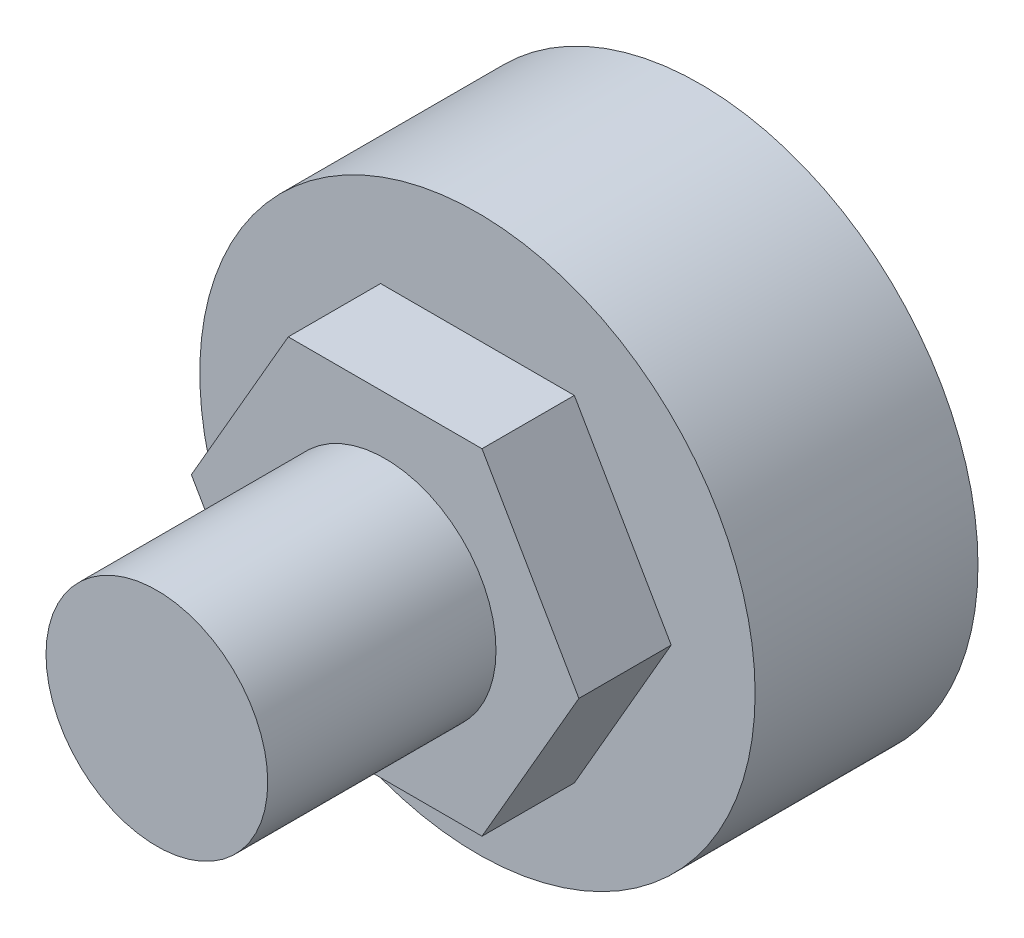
ISO-10303-21;
HEADER;
FILE_DESCRIPTION(('STEP AP214'),'2;1');
FILE_NAME('part.step','',(''),(''),'','','');
FILE_SCHEMA(('AUTOMOTIVE_DESIGN { 1 0 10303 214 1 1 1 1 }'));
ENDSEC;
DATA;
#1=APPLICATION_CONTEXT('core data for automotive mechanical design processes');
#2=APPLICATION_PROTOCOL_DEFINITION('international standard','automotive_design',2000,#1);
#3=PRODUCT_CONTEXT('',#1,'mechanical');
#4=PRODUCT('Part','Part','',(#3));
#5=PRODUCT_RELATED_PRODUCT_CATEGORY('part','',(#4));
#6=PRODUCT_DEFINITION_FORMATION('','',#4);
#7=PRODUCT_DEFINITION_CONTEXT('part definition',#1,'design');
#8=PRODUCT_DEFINITION('design','',#6,#7);
#9=PRODUCT_DEFINITION_SHAPE('','',#8);
#10=(LENGTH_UNIT() NAMED_UNIT(*) SI_UNIT(.MILLI.,.METRE.));
#11=(NAMED_UNIT(*) PLANE_ANGLE_UNIT() SI_UNIT($,.RADIAN.));
#12=(NAMED_UNIT(*) SI_UNIT($,.STERADIAN.) SOLID_ANGLE_UNIT());
#13=UNCERTAINTY_MEASURE_WITH_UNIT(LENGTH_MEASURE(1.E-05),#10,'distance_accuracy_value','');
#14=(GEOMETRIC_REPRESENTATION_CONTEXT(3) GLOBAL_UNCERTAINTY_ASSIGNED_CONTEXT((#13)) GLOBAL_UNIT_ASSIGNED_CONTEXT((#10,
#11,#12)) REPRESENTATION_CONTEXT('',''));
#15=CARTESIAN_POINT('',(0.,0.,0.));
#16=DIRECTION('',(0.,0.,1.));
#17=DIRECTION('',(1.,0.,0.));
#18=AXIS2_PLACEMENT_3D('',#15,#16,#17);
#19=CARTESIAN_POINT('',(0.,0.,11.13));
#20=DIRECTION('',(0.,0.,1.));
#21=DIRECTION('',(1.,0.,0.));
#22=AXIS2_PLACEMENT_3D('',#19,#20,#21);
#23=PLANE('',#22);
#24=DIRECTION('',(-0.5,0.866025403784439,0.));
#25=VECTOR('',#24,1.);
#26=CARTESIAN_POINT('',(6.84160068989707,0.,11.13));
#27=LINE('',#26,#25);
#28=CARTESIAN_POINT('',(6.84160068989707,0.,11.13));
#29=VERTEX_POINT('',#28);
#30=CARTESIAN_POINT('',(3.42080034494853,5.925,11.13));
#31=VERTEX_POINT('',#30);
#32=EDGE_CURVE('E145',#29,#31,#27,.T.);
#33=ORIENTED_EDGE('',*,*,#32,.T.);
#34=DIRECTION('',(-1.,0.,0.));
#35=VECTOR('',#34,1.);
#36=CARTESIAN_POINT('',(3.42080034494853,5.925,11.13));
#37=LINE('',#36,#35);
#38=CARTESIAN_POINT('',(-3.42080034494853,5.925,11.13));
#39=VERTEX_POINT('',#38);
#40=EDGE_CURVE('E91',#31,#39,#37,.T.);
#41=ORIENTED_EDGE('',*,*,#40,.T.);
#42=DIRECTION('',(-0.5,-0.866025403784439,0.));
#43=VECTOR('',#42,1.);
#44=CARTESIAN_POINT('',(-3.42080034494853,5.925,11.13));
#45=LINE('',#44,#43);
#46=CARTESIAN_POINT('',(-6.84160068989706,0.,11.13));
#47=VERTEX_POINT('',#46);
#48=EDGE_CURVE('E107',#39,#47,#45,.T.);
#49=ORIENTED_EDGE('',*,*,#48,.T.);
#50=DIRECTION('',(0.5,-0.866025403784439,0.));
#51=VECTOR('',#50,1.);
#52=CARTESIAN_POINT('',(-6.84160068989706,0.,11.13));
#53=LINE('',#52,#51);
#54=CARTESIAN_POINT('',(-3.42080034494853,-5.925,11.13));
#55=VERTEX_POINT('',#54);
#56=EDGE_CURVE('E101',#47,#55,#53,.T.);
#57=ORIENTED_EDGE('',*,*,#56,.T.);
#58=DIRECTION('',(1.,0.,0.));
#59=VECTOR('',#58,1.);
#60=CARTESIAN_POINT('',(-3.42080034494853,-5.925,11.13));
#61=LINE('',#60,#59);
#62=CARTESIAN_POINT('',(3.42080034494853,-5.925,11.13));
#63=VERTEX_POINT('',#62);
#64=EDGE_CURVE('E105',#55,#63,#61,.T.);
#65=ORIENTED_EDGE('',*,*,#64,.T.);
#66=DIRECTION('',(0.5,0.866025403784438,0.));
#67=VECTOR('',#66,1.);
#68=CARTESIAN_POINT('',(3.42080034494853,-5.925,11.13));
#69=LINE('',#68,#67);
#70=EDGE_CURVE('E61',#63,#29,#69,.T.);
#71=ORIENTED_EDGE('',*,*,#70,.T.);
#72=EDGE_LOOP('',(#33,#41,#49,#57,#65,#71));
#73=FACE_BOUND('',#72,.T.);
#74=CARTESIAN_POINT('',(0.,0.,11.13));
#75=DIRECTION('',(0.,0.,1.));
#76=DIRECTION('',(1.,0.,0.));
#77=AXIS2_PLACEMENT_3D('',#74,#75,#76);
#78=CIRCLE('',#77,3.915);
#79=CARTESIAN_POINT('',(3.915,0.,11.13));
#80=VERTEX_POINT('',#79);
#81=EDGE_CURVE('E207',#80,#80,#78,.T.);
#82=ORIENTED_EDGE('',*,*,#81,.F.);
#83=EDGE_LOOP('',(#82));
#84=FACE_BOUND('',#83,.T.);
#85=ADVANCED_FACE('F37',(#73,#84),#23,.T.);
#86=CARTESIAN_POINT('',(0.,0.,7.87));
#87=DIRECTION('',(0.,0.,1.));
#88=DIRECTION('',(1.,0.,0.));
#89=AXIS2_PLACEMENT_3D('',#86,#87,#88);
#90=PLANE('',#89);
#91=CARTESIAN_POINT('',(0.,0.,7.87));
#92=DIRECTION('',(0.,0.,1.));
#93=DIRECTION('',(1.,0.,0.));
#94=AXIS2_PLACEMENT_3D('',#91,#92,#93);
#95=CIRCLE('',#94,9.805);
#96=CARTESIAN_POINT('',(9.805,0.,7.87));
#97=VERTEX_POINT('',#96);
#98=EDGE_CURVE('E11',#97,#97,#95,.T.);
#99=ORIENTED_EDGE('',*,*,#98,.T.);
#100=EDGE_LOOP('',(#99));
#101=FACE_BOUND('',#100,.T.);
#102=DIRECTION('',(-1.,0.,0.));
#103=VECTOR('',#102,1.);
#104=CARTESIAN_POINT('',(3.42080034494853,5.925,7.87));
#105=LINE('',#104,#103);
#106=CARTESIAN_POINT('',(3.42080034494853,5.925,7.87));
#107=VERTEX_POINT('',#106);
#108=CARTESIAN_POINT('',(-3.42080034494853,5.925,7.87));
#109=VERTEX_POINT('',#108);
#110=EDGE_CURVE('E134',#107,#109,#105,.T.);
#111=ORIENTED_EDGE('',*,*,#110,.F.);
#112=DIRECTION('',(-0.5,0.866025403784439,0.));
#113=VECTOR('',#112,1.);
#114=CARTESIAN_POINT('',(6.84160068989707,0.,7.87));
#115=LINE('',#114,#113);
#116=CARTESIAN_POINT('',(6.84160068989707,0.,7.87));
#117=VERTEX_POINT('',#116);
#118=EDGE_CURVE('E131',#117,#107,#115,.T.);
#119=ORIENTED_EDGE('',*,*,#118,.F.);
#120=DIRECTION('',(0.5,0.866025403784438,0.));
#121=VECTOR('',#120,1.);
#122=CARTESIAN_POINT('',(3.42080034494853,-5.925,7.87));
#123=LINE('',#122,#121);
#124=CARTESIAN_POINT('',(3.42080034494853,-5.925,7.87));
#125=VERTEX_POINT('',#124);
#126=EDGE_CURVE('E83',#125,#117,#123,.T.);
#127=ORIENTED_EDGE('',*,*,#126,.F.);
#128=DIRECTION('',(1.,0.,0.));
#129=VECTOR('',#128,1.);
#130=CARTESIAN_POINT('',(-3.42080034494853,-5.925,7.87));
#131=LINE('',#130,#129);
#132=CARTESIAN_POINT('',(-3.42080034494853,-5.925,7.87));
#133=VERTEX_POINT('',#132);
#134=EDGE_CURVE('E141',#133,#125,#131,.T.);
#135=ORIENTED_EDGE('',*,*,#134,.F.);
#136=DIRECTION('',(0.5,-0.866025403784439,0.));
#137=VECTOR('',#136,1.);
#138=CARTESIAN_POINT('',(-6.84160068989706,0.,7.87));
#139=LINE('',#138,#137);
#140=CARTESIAN_POINT('',(-6.84160068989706,0.,7.87));
#141=VERTEX_POINT('',#140);
#142=EDGE_CURVE('E117',#141,#133,#139,.T.);
#143=ORIENTED_EDGE('',*,*,#142,.F.);
#144=DIRECTION('',(-0.5,-0.866025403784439,0.));
#145=VECTOR('',#144,1.);
#146=CARTESIAN_POINT('',(-3.42080034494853,5.925,7.87));
#147=LINE('',#146,#145);
#148=EDGE_CURVE('E137',#109,#141,#147,.T.);
#149=ORIENTED_EDGE('',*,*,#148,.F.);
#150=EDGE_LOOP('',(#111,#119,#127,#135,#143,#149));
#151=FACE_BOUND('',#150,.T.);
#152=ADVANCED_FACE('F171',(#101,#151),#90,.T.);
#153=CARTESIAN_POINT('',(0.,0.,7.87));
#154=DIRECTION('',(0.,0.,-1.));
#155=DIRECTION('',(-1.,0.,0.));
#156=AXIS2_PLACEMENT_3D('',#153,#154,#155);
#157=CYLINDRICAL_SURFACE('',#156,9.805);
#158=ORIENTED_EDGE('',*,*,#98,.F.);
#159=EDGE_LOOP('',(#158));
#160=FACE_BOUND('',#159,.T.);
#161=CARTESIAN_POINT('',(0.,0.,0.));
#162=DIRECTION('',(0.,0.,1.));
#163=DIRECTION('',(1.,0.,0.));
#164=AXIS2_PLACEMENT_3D('',#161,#162,#163);
#165=CIRCLE('',#164,9.805);
#166=CARTESIAN_POINT('',(9.805,0.,0.));
#167=VERTEX_POINT('',#166);
#168=EDGE_CURVE('E41',#167,#167,#165,.T.);
#169=ORIENTED_EDGE('',*,*,#168,.T.);
#170=EDGE_LOOP('',(#169));
#171=FACE_BOUND('',#170,.T.);
#172=ADVANCED_FACE('F39',(#160,#171),#157,.T.);
#173=CARTESIAN_POINT('',(0.,0.,0.));
#174=DIRECTION('',(0.,0.,1.));
#175=DIRECTION('',(1.,0.,0.));
#176=AXIS2_PLACEMENT_3D('',#173,#174,#175);
#177=PLANE('',#176);
#178=ORIENTED_EDGE('',*,*,#168,.F.);
#179=EDGE_LOOP('',(#178));
#180=FACE_BOUND('',#179,.T.);
#181=ADVANCED_FACE('F161',(#180),#177,.F.);
#182=CARTESIAN_POINT('',(6.84160068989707,0.,11.13));
#183=DIRECTION('',(-0.866025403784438,-0.5,0.));
#184=DIRECTION('',(0.5,-0.866025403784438,0.));
#185=AXIS2_PLACEMENT_3D('',#182,#183,#184);
#186=PLANE('',#185);
#187=ORIENTED_EDGE('',*,*,#118,.T.);
#188=DIRECTION('',(0.,0.,-1.));
#189=VECTOR('',#188,1.);
#190=CARTESIAN_POINT('',(3.42080034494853,5.925,11.13));
#191=LINE('',#190,#189);
#192=EDGE_CURVE('E155',#31,#107,#191,.T.);
#193=ORIENTED_EDGE('',*,*,#192,.F.);
#194=ORIENTED_EDGE('',*,*,#32,.F.);
#195=DIRECTION('',(0.,0.,-1.));
#196=VECTOR('',#195,1.);
#197=CARTESIAN_POINT('',(6.84160068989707,0.,11.13));
#198=LINE('',#197,#196);
#199=EDGE_CURVE('E127',#29,#117,#198,.T.);
#200=ORIENTED_EDGE('',*,*,#199,.T.);
#201=EDGE_LOOP('',(#187,#193,#194,#200));
#202=FACE_BOUND('',#201,.T.);
#203=ADVANCED_FACE('F163',(#202),#186,.F.);
#204=CARTESIAN_POINT('',(3.42080034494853,5.925,11.13));
#205=DIRECTION('',(0.,-1.,0.));
#206=DIRECTION('',(1.,0.,0.));
#207=AXIS2_PLACEMENT_3D('',#204,#205,#206);
#208=PLANE('',#207);
#209=ORIENTED_EDGE('',*,*,#110,.T.);
#210=DIRECTION('',(0.,0.,-1.));
#211=VECTOR('',#210,1.);
#212=CARTESIAN_POINT('',(-3.42080034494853,5.925,11.13));
#213=LINE('',#212,#211);
#214=EDGE_CURVE('E151',#39,#109,#213,.T.);
#215=ORIENTED_EDGE('',*,*,#214,.F.);
#216=ORIENTED_EDGE('',*,*,#40,.F.);
#217=ORIENTED_EDGE('',*,*,#192,.T.);
#218=EDGE_LOOP('',(#209,#215,#216,#217));
#219=FACE_BOUND('',#218,.T.);
#220=ADVANCED_FACE('F168',(#219),#208,.F.);
#221=CARTESIAN_POINT('',(-3.42080034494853,5.925,11.13));
#222=DIRECTION('',(0.866025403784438,-0.5,0.));
#223=DIRECTION('',(0.5,0.866025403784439,0.));
#224=AXIS2_PLACEMENT_3D('',#221,#222,#223);
#225=PLANE('',#224);
#226=ORIENTED_EDGE('',*,*,#148,.T.);
#227=DIRECTION('',(0.,0.,-1.));
#228=VECTOR('',#227,1.);
#229=CARTESIAN_POINT('',(-6.84160068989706,0.,11.13));
#230=LINE('',#229,#228);
#231=EDGE_CURVE('E121',#47,#141,#230,.T.);
#232=ORIENTED_EDGE('',*,*,#231,.F.);
#233=ORIENTED_EDGE('',*,*,#48,.F.);
#234=ORIENTED_EDGE('',*,*,#214,.T.);
#235=EDGE_LOOP('',(#226,#232,#233,#234));
#236=FACE_BOUND('',#235,.T.);
#237=ADVANCED_FACE('F191',(#236),#225,.F.);
#238=CARTESIAN_POINT('',(-6.84160068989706,0.,11.13));
#239=DIRECTION('',(0.866025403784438,0.5,0.));
#240=DIRECTION('',(-0.5,0.866025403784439,0.));
#241=AXIS2_PLACEMENT_3D('',#238,#239,#240);
#242=PLANE('',#241);
#243=ORIENTED_EDGE('',*,*,#142,.T.);
#244=DIRECTION('',(0.,0.,-1.));
#245=VECTOR('',#244,1.);
#246=CARTESIAN_POINT('',(-3.42080034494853,-5.925,11.13));
#247=LINE('',#246,#245);
#248=EDGE_CURVE('E114',#55,#133,#247,.T.);
#249=ORIENTED_EDGE('',*,*,#248,.F.);
#250=ORIENTED_EDGE('',*,*,#56,.F.);
#251=ORIENTED_EDGE('',*,*,#231,.T.);
#252=EDGE_LOOP('',(#243,#249,#250,#251));
#253=FACE_BOUND('',#252,.T.);
#254=ADVANCED_FACE('F115',(#253),#242,.F.);
#255=CARTESIAN_POINT('',(-3.42080034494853,-5.925,11.13));
#256=DIRECTION('',(0.,1.,0.));
#257=DIRECTION('',(0.,0.,1.));
#258=AXIS2_PLACEMENT_3D('',#255,#256,#257);
#259=PLANE('',#258);
#260=ORIENTED_EDGE('',*,*,#134,.T.);
#261=DIRECTION('',(0.,0.,-1.));
#262=VECTOR('',#261,1.);
#263=CARTESIAN_POINT('',(3.42080034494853,-5.925,11.13));
#264=LINE('',#263,#262);
#265=EDGE_CURVE('E53',#63,#125,#264,.T.);
#266=ORIENTED_EDGE('',*,*,#265,.F.);
#267=ORIENTED_EDGE('',*,*,#64,.F.);
#268=ORIENTED_EDGE('',*,*,#248,.T.);
#269=EDGE_LOOP('',(#260,#266,#267,#268));
#270=FACE_BOUND('',#269,.T.);
#271=ADVANCED_FACE('F123',(#270),#259,.F.);
#272=CARTESIAN_POINT('',(3.42080034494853,-5.925,11.13));
#273=DIRECTION('',(-0.866025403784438,0.5,0.));
#274=DIRECTION('',(-0.5,-0.866025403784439,0.));
#275=AXIS2_PLACEMENT_3D('',#272,#273,#274);
#276=PLANE('',#275);
#277=ORIENTED_EDGE('',*,*,#126,.T.);
#278=ORIENTED_EDGE('',*,*,#199,.F.);
#279=ORIENTED_EDGE('',*,*,#70,.F.);
#280=ORIENTED_EDGE('',*,*,#265,.T.);
#281=EDGE_LOOP('',(#277,#278,#279,#280));
#282=FACE_BOUND('',#281,.T.);
#283=ADVANCED_FACE('F184',(#282),#276,.F.);
#284=CARTESIAN_POINT('',(0.,0.,19.19));
#285=DIRECTION('',(0.,0.,-1.));
#286=DIRECTION('',(-1.,0.,0.));
#287=AXIS2_PLACEMENT_3D('',#284,#285,#286);
#288=CYLINDRICAL_SURFACE('',#287,3.915);
#289=CARTESIAN_POINT('',(0.,0.,19.19));
#290=DIRECTION('',(0.,0.,1.));
#291=DIRECTION('',(1.,0.,0.));
#292=AXIS2_PLACEMENT_3D('',#289,#290,#291);
#293=CIRCLE('',#292,3.915);
#294=CARTESIAN_POINT('',(3.915,0.,19.19));
#295=VERTEX_POINT('',#294);
#296=EDGE_CURVE('E135',#295,#295,#293,.T.);
#297=ORIENTED_EDGE('',*,*,#296,.F.);
#298=EDGE_LOOP('',(#297));
#299=FACE_BOUND('',#298,.T.);
#300=ORIENTED_EDGE('',*,*,#81,.T.);
#301=EDGE_LOOP('',(#300));
#302=FACE_BOUND('',#301,.T.);
#303=ADVANCED_FACE('F182',(#299,#302),#288,.T.);
#304=CARTESIAN_POINT('',(0.,0.,19.19));
#305=DIRECTION('',(0.,0.,1.));
#306=DIRECTION('',(1.,0.,0.));
#307=AXIS2_PLACEMENT_3D('',#304,#305,#306);
#308=PLANE('',#307);
#309=ORIENTED_EDGE('',*,*,#296,.T.);
#310=EDGE_LOOP('',(#309));
#311=FACE_BOUND('',#310,.T.);
#312=ADVANCED_FACE('F217',(#311),#308,.T.);
#313=CLOSED_SHELL('',(#85,#152,#172,#181,#203,#220,#237,#254,#271,#283,#303,#312));
#314=MANIFOLD_SOLID_BREP('B2',#313);
#315=ADVANCED_BREP_SHAPE_REPRESENTATION('',(#18,#314),#14);
#316=SHAPE_DEFINITION_REPRESENTATION(#9,#315);
ENDSEC;
END-ISO-10303-21;
